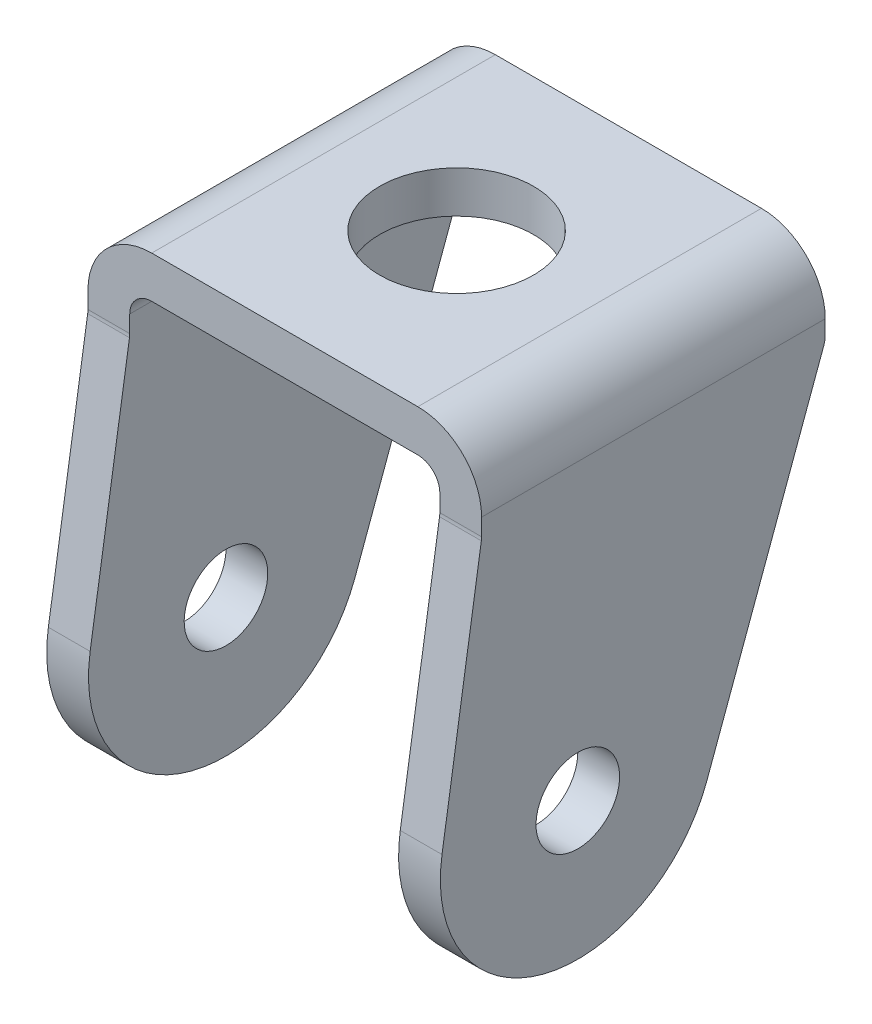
ISO-10303-21;
HEADER;
FILE_DESCRIPTION(('STEP AP214'),'2;1');
FILE_NAME('part.step','',(''),(''),'','','');
FILE_SCHEMA(('AUTOMOTIVE_DESIGN { 1 0 10303 214 1 1 1 1 }'));
ENDSEC;
DATA;
#1=APPLICATION_CONTEXT('core data for automotive mechanical design processes');
#2=APPLICATION_PROTOCOL_DEFINITION('international standard','automotive_design',2000,#1);
#3=PRODUCT_CONTEXT('',#1,'mechanical');
#4=PRODUCT('Part','Part','',(#3));
#5=PRODUCT_RELATED_PRODUCT_CATEGORY('part','',(#4));
#6=PRODUCT_DEFINITION_FORMATION('','',#4);
#7=PRODUCT_DEFINITION_CONTEXT('part definition',#1,'design');
#8=PRODUCT_DEFINITION('design','',#6,#7);
#9=PRODUCT_DEFINITION_SHAPE('','',#8);
#10=(LENGTH_UNIT() NAMED_UNIT(*) SI_UNIT(.MILLI.,.METRE.));
#11=(NAMED_UNIT(*) PLANE_ANGLE_UNIT() SI_UNIT($,.RADIAN.));
#12=(NAMED_UNIT(*) SI_UNIT($,.STERADIAN.) SOLID_ANGLE_UNIT());
#13=UNCERTAINTY_MEASURE_WITH_UNIT(LENGTH_MEASURE(1.E-05),#10,'distance_accuracy_value','');
#14=(GEOMETRIC_REPRESENTATION_CONTEXT(3) GLOBAL_UNCERTAINTY_ASSIGNED_CONTEXT((#13)) GLOBAL_UNIT_ASSIGNED_CONTEXT((#10,
#11,#12)) REPRESENTATION_CONTEXT('',''));
#15=CARTESIAN_POINT('',(0.,0.,0.));
#16=DIRECTION('',(0.,0.,1.));
#17=DIRECTION('',(1.,0.,0.));
#18=AXIS2_PLACEMENT_3D('',#15,#16,#17);
#19=CARTESIAN_POINT('',(40.64,0.,44.45));
#20=DIRECTION('',(1.,0.,0.));
#21=DIRECTION('',(0.,1.,0.));
#22=AXIS2_PLACEMENT_3D('',#19,#20,#21);
#23=PLANE('',#22);
#24=CARTESIAN_POINT('',(40.64,-41.275,28.575));
#25=DIRECTION('',(1.,0.,0.));
#26=DIRECTION('',(0.,1.,0.));
#27=AXIS2_PLACEMENT_3D('',#24,#25,#26);
#28=CIRCLE('',#27,4.826);
#29=CARTESIAN_POINT('',(40.64,-36.449,28.575));
#30=VERTEX_POINT('',#29);
#31=EDGE_CURVE('E382',#30,#30,#28,.T.);
#32=ORIENTED_EDGE('',*,*,#31,.T.);
#33=EDGE_LOOP('',(#32));
#34=FACE_BOUND('',#33,.T.);
#35=DIRECTION('',(0.,-1.,0.));
#36=VECTOR('',#35,1.);
#37=CARTESIAN_POINT('',(40.64,0.,0.));
#38=LINE('',#37,#36);
#39=CARTESIAN_POINT('',(40.64,-7.366,0.));
#40=VERTEX_POINT('',#39);
#41=CARTESIAN_POINT('',(40.64,-9.07324358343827,0.));
#42=VERTEX_POINT('',#41);
#43=EDGE_CURVE('E438',#40,#42,#38,.T.);
#44=ORIENTED_EDGE('',*,*,#43,.T.);
#45=CARTESIAN_POINT('',(40.64,-9.07324358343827,2.54));
#46=DIRECTION('',(1.,0.,0.));
#47=DIRECTION('',(0.,1.,0.));
#48=AXIS2_PLACEMENT_3D('',#45,#46,#47);
#49=CIRCLE('',#48,2.54);
#50=CARTESIAN_POINT('',(40.64,-9.94905191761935,0.155768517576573));
#51=VERTEX_POINT('',#50);
#52=EDGE_CURVE('E482',#42,#51,#49,.F.);
#53=ORIENTED_EDGE('',*,*,#52,.T.);
#54=DIRECTION('',(0.,-0.938673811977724,0.344806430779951));
#55=VECTOR('',#54,1.);
#56=CARTESIAN_POINT('',(40.64,-15.5191623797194,2.20185724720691));
#57=LINE('',#56,#55);
#58=CARTESIAN_POINT('',(40.64,-46.7488020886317,13.6735532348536));
#59=VERTEX_POINT('',#58);
#60=EDGE_CURVE('E407',#51,#59,#57,.T.);
#61=ORIENTED_EDGE('',*,*,#60,.T.);
#62=CARTESIAN_POINT('',(40.64,-41.275,28.575));
#63=DIRECTION('',(1.,0.,0.));
#64=DIRECTION('',(0.,1.,0.));
#65=AXIS2_PLACEMENT_3D('',#62,#63,#64);
#66=CIRCLE('',#65,15.875);
#67=CARTESIAN_POINT('',(40.64,-38.8273080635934,44.2601658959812));
#68=VERTEX_POINT('',#67);
#69=EDGE_CURVE('E426',#68,#59,#66,.T.);
#70=ORIENTED_EDGE('',*,*,#69,.F.);
#71=DIRECTION('',(0.,0.988041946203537,-0.154185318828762));
#72=VECTOR('',#71,1.);
#73=CARTESIAN_POINT('',(40.64,-0.95196558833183,38.3496660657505));
#74=LINE('',#73,#72);
#75=CARTESIAN_POINT('',(40.64,-9.71963752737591,39.717873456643));
#76=VERTEX_POINT('',#75);
#77=EDGE_CURVE('E435',#68,#76,#74,.T.);
#78=ORIENTED_EDGE('',*,*,#77,.T.);
#79=CARTESIAN_POINT('',(40.64,-9.32800681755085,42.2275));
#80=DIRECTION('',(1.,0.,0.));
#81=DIRECTION('',(0.,1.,0.));
#82=AXIS2_PLACEMENT_3D('',#79,#80,#81);
#83=CIRCLE('',#82,2.54);
#84=CARTESIAN_POINT('',(40.64,-9.32800681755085,39.6875));
#85=VERTEX_POINT('',#84);
#86=EDGE_CURVE('E508',#76,#85,#83,.T.);
#87=ORIENTED_EDGE('',*,*,#86,.T.);
#88=DIRECTION('',(0.,1.,0.));
#89=VECTOR('',#88,1.);
#90=CARTESIAN_POINT('',(40.64,0.,39.6875));
#91=LINE('',#90,#89);
#92=CARTESIAN_POINT('',(40.64,-7.366,39.6875));
#93=VERTEX_POINT('',#92);
#94=EDGE_CURVE('E432',#85,#93,#91,.T.);
#95=ORIENTED_EDGE('',*,*,#94,.T.);
#96=DIRECTION('',(0.,0.,-1.));
#97=VECTOR('',#96,1.);
#98=CARTESIAN_POINT('',(40.64,-7.366,0.));
#99=LINE('',#98,#97);
#100=EDGE_CURVE('E479',#93,#40,#99,.T.);
#101=ORIENTED_EDGE('',*,*,#100,.T.);
#102=EDGE_LOOP('',(#44,#53,#61,#70,#78,#87,#95,#101));
#103=FACE_BOUND('',#102,.T.);
#104=ADVANCED_FACE('F229',(#34,#103),#23,.F.);
#105=CARTESIAN_POINT('',(45.466,0.,44.45));
#106=DIRECTION('',(1.,0.,0.));
#107=DIRECTION('',(0.,1.,0.));
#108=AXIS2_PLACEMENT_3D('',#105,#106,#107);
#109=PLANE('',#108);
#110=CARTESIAN_POINT('',(45.466,-41.275,28.575));
#111=DIRECTION('',(-1.,0.,0.));
#112=DIRECTION('',(0.,-1.,0.));
#113=AXIS2_PLACEMENT_3D('',#110,#111,#112);
#114=CIRCLE('',#113,4.826);
#115=CARTESIAN_POINT('',(45.466,-46.101,28.575));
#116=VERTEX_POINT('',#115);
#117=EDGE_CURVE('E464',#116,#116,#114,.T.);
#118=ORIENTED_EDGE('',*,*,#117,.T.);
#119=EDGE_LOOP('',(#118));
#120=FACE_BOUND('',#119,.T.);
#121=DIRECTION('',(0.,-1.,0.));
#122=VECTOR('',#121,1.);
#123=CARTESIAN_POINT('',(45.466,0.,0.));
#124=LINE('',#123,#122);
#125=CARTESIAN_POINT('',(45.466,-7.366,0.));
#126=VERTEX_POINT('',#125);
#127=CARTESIAN_POINT('',(45.466,-9.07324358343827,0.));
#128=VERTEX_POINT('',#127);
#129=EDGE_CURVE('E441',#126,#128,#124,.T.);
#130=ORIENTED_EDGE('',*,*,#129,.F.);
#131=DIRECTION('',(0.,0.,-1.));
#132=VECTOR('',#131,1.);
#133=CARTESIAN_POINT('',(45.466,-7.366,44.45));
#134=LINE('',#133,#132);
#135=CARTESIAN_POINT('',(45.466,-7.366,39.6875));
#136=VERTEX_POINT('',#135);
#137=EDGE_CURVE('E251',#126,#136,#134,.F.);
#138=ORIENTED_EDGE('',*,*,#137,.T.);
#139=DIRECTION('',(0.,1.,0.));
#140=VECTOR('',#139,1.);
#141=CARTESIAN_POINT('',(45.466,-28.575,39.6875));
#142=LINE('',#141,#140);
#143=CARTESIAN_POINT('',(45.466,-9.32800681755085,39.6875));
#144=VERTEX_POINT('',#143);
#145=EDGE_CURVE('E393',#144,#136,#142,.T.);
#146=ORIENTED_EDGE('',*,*,#145,.F.);
#147=CARTESIAN_POINT('',(45.466,-9.32800681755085,42.2275));
#148=DIRECTION('',(1.,0.,0.));
#149=DIRECTION('',(0.,1.,0.));
#150=AXIS2_PLACEMENT_3D('',#147,#148,#149);
#151=CIRCLE('',#150,2.54);
#152=CARTESIAN_POINT('',(45.466,-9.7196375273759,39.717873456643));
#153=VERTEX_POINT('',#152);
#154=EDGE_CURVE('E506',#144,#153,#151,.F.);
#155=ORIENTED_EDGE('',*,*,#154,.T.);
#156=DIRECTION('',(0.,0.988041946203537,-0.154185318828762));
#157=VECTOR('',#156,1.);
#158=CARTESIAN_POINT('',(45.466,-16.8612179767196,40.8323270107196));
#159=LINE('',#158,#157);
#160=CARTESIAN_POINT('',(45.466,-38.8273080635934,44.2601658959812));
#161=VERTEX_POINT('',#160);
#162=EDGE_CURVE('E412',#161,#153,#159,.T.);
#163=ORIENTED_EDGE('',*,*,#162,.F.);
#164=CARTESIAN_POINT('',(45.466,-41.275,28.575));
#165=DIRECTION('',(1.,0.,0.));
#166=DIRECTION('',(0.,1.,0.));
#167=AXIS2_PLACEMENT_3D('',#164,#165,#166);
#168=CIRCLE('',#167,15.875);
#169=CARTESIAN_POINT('',(45.466,-46.7488020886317,13.6735532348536));
#170=VERTEX_POINT('',#169);
#171=EDGE_CURVE('E409',#161,#170,#168,.T.);
#172=ORIENTED_EDGE('',*,*,#171,.T.);
#173=DIRECTION('',(0.,-0.938673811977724,0.344806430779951));
#174=VECTOR('',#173,1.);
#175=CARTESIAN_POINT('',(45.466,-15.2307912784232,2.09592885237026));
#176=LINE('',#175,#174);
#177=CARTESIAN_POINT('',(45.466,-9.94905191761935,0.155768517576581));
#178=VERTEX_POINT('',#177);
#179=EDGE_CURVE('E399',#178,#170,#176,.T.);
#180=ORIENTED_EDGE('',*,*,#179,.F.);
#181=CARTESIAN_POINT('',(45.466,-9.07324358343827,2.54));
#182=DIRECTION('',(1.,0.,0.));
#183=DIRECTION('',(0.,1.,0.));
#184=AXIS2_PLACEMENT_3D('',#181,#182,#183);
#185=CIRCLE('',#184,2.54);
#186=EDGE_CURVE('E472',#178,#128,#185,.T.);
#187=ORIENTED_EDGE('',*,*,#186,.T.);
#188=EDGE_LOOP('',(#130,#138,#146,#155,#163,#172,#180,#187));
#189=FACE_BOUND('',#188,.T.);
#190=ADVANCED_FACE('F543',(#120,#189),#109,.T.);
#191=CARTESIAN_POINT('',(0.,0.,44.45));
#192=DIRECTION('',(-1.,0.,0.));
#193=DIRECTION('',(0.,-1.,0.));
#194=AXIS2_PLACEMENT_3D('',#191,#192,#193);
#195=PLANE('',#194);
#196=CARTESIAN_POINT('',(0.,-41.275,28.575));
#197=DIRECTION('',(-1.,0.,0.));
#198=DIRECTION('',(0.,-1.,0.));
#199=AXIS2_PLACEMENT_3D('',#196,#197,#198);
#200=CIRCLE('',#199,4.826);
#201=CARTESIAN_POINT('',(0.,-46.101,28.575));
#202=VERTEX_POINT('',#201);
#203=EDGE_CURVE('E468',#202,#202,#200,.T.);
#204=ORIENTED_EDGE('',*,*,#203,.F.);
#205=EDGE_LOOP('',(#204));
#206=FACE_BOUND('',#205,.T.);
#207=DIRECTION('',(0.,1.,0.));
#208=VECTOR('',#207,1.);
#209=CARTESIAN_POINT('',(0.,-28.575,39.6875));
#210=LINE('',#209,#208);
#211=CARTESIAN_POINT('',(0.,-9.32800681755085,39.6875));
#212=VERTEX_POINT('',#211);
#213=CARTESIAN_POINT('',(0.,-7.366,39.6875));
#214=VERTEX_POINT('',#213);
#215=EDGE_CURVE('E417',#212,#214,#210,.T.);
#216=ORIENTED_EDGE('',*,*,#215,.T.);
#217=DIRECTION('',(0.,0.,-1.));
#218=VECTOR('',#217,1.);
#219=CARTESIAN_POINT('',(0.,-7.366,44.45));
#220=LINE('',#219,#218);
#221=CARTESIAN_POINT('',(0.,-7.366,0.));
#222=VERTEX_POINT('',#221);
#223=EDGE_CURVE('E12',#214,#222,#220,.T.);
#224=ORIENTED_EDGE('',*,*,#223,.T.);
#225=DIRECTION('',(0.,1.,0.));
#226=VECTOR('',#225,1.);
#227=CARTESIAN_POINT('',(0.,0.,0.));
#228=LINE('',#227,#226);
#229=CARTESIAN_POINT('',(0.,-9.07324358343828,0.));
#230=VERTEX_POINT('',#229);
#231=EDGE_CURVE('E446',#230,#222,#228,.T.);
#232=ORIENTED_EDGE('',*,*,#231,.F.);
#233=CARTESIAN_POINT('',(0.,-9.07324358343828,2.54));
#234=DIRECTION('',(-1.,0.,0.));
#235=DIRECTION('',(0.,-1.,0.));
#236=AXIS2_PLACEMENT_3D('',#233,#234,#235);
#237=CIRCLE('',#236,2.54);
#238=CARTESIAN_POINT('',(0.,-9.94905191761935,0.155768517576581));
#239=VERTEX_POINT('',#238);
#240=EDGE_CURVE('E376',#230,#239,#237,.T.);
#241=ORIENTED_EDGE('',*,*,#240,.T.);
#242=DIRECTION('',(0.,-0.938673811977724,0.344806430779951));
#243=VECTOR('',#242,1.);
#244=CARTESIAN_POINT('',(0.,-15.2307912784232,2.09592885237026));
#245=LINE('',#244,#243);
#246=CARTESIAN_POINT('',(0.,-46.7488020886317,13.6735532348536));
#247=VERTEX_POINT('',#246);
#248=EDGE_CURVE('E369',#239,#247,#245,.T.);
#249=ORIENTED_EDGE('',*,*,#248,.T.);
#250=CARTESIAN_POINT('',(0.,-41.275,28.575));
#251=DIRECTION('',(1.,0.,0.));
#252=DIRECTION('',(0.,1.,0.));
#253=AXIS2_PLACEMENT_3D('',#250,#251,#252);
#254=CIRCLE('',#253,15.875);
#255=CARTESIAN_POINT('',(0.,-38.8273080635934,44.2601658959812));
#256=VERTEX_POINT('',#255);
#257=EDGE_CURVE('E373',#256,#247,#254,.T.);
#258=ORIENTED_EDGE('',*,*,#257,.F.);
#259=DIRECTION('',(0.,0.988041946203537,-0.154185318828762));
#260=VECTOR('',#259,1.);
#261=CARTESIAN_POINT('',(0.,-16.8612179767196,40.8323270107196));
#262=LINE('',#261,#260);
#263=CARTESIAN_POINT('',(0.,-9.71963752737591,39.717873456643));
#264=VERTEX_POINT('',#263);
#265=EDGE_CURVE('E392',#256,#264,#262,.T.);
#266=ORIENTED_EDGE('',*,*,#265,.T.);
#267=CARTESIAN_POINT('',(0.,-9.32800681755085,42.2275));
#268=DIRECTION('',(-1.,0.,0.));
#269=DIRECTION('',(0.,-1.,0.));
#270=AXIS2_PLACEMENT_3D('',#267,#268,#269);
#271=CIRCLE('',#270,2.54);
#272=EDGE_CURVE('E512',#264,#212,#271,.F.);
#273=ORIENTED_EDGE('',*,*,#272,.T.);
#274=EDGE_LOOP('',(#216,#224,#232,#241,#249,#258,#266,#273));
#275=FACE_BOUND('',#274,.T.);
#276=ADVANCED_FACE('F371',(#206,#275),#195,.T.);
#277=CARTESIAN_POINT('',(4.826,0.,44.45));
#278=DIRECTION('',(-1.,0.,0.));
#279=DIRECTION('',(0.,-1.,0.));
#280=AXIS2_PLACEMENT_3D('',#277,#278,#279);
#281=PLANE('',#280);
#282=CARTESIAN_POINT('',(4.826,-41.275,28.575));
#283=DIRECTION('',(-1.,0.,0.));
#284=DIRECTION('',(0.,-1.,0.));
#285=AXIS2_PLACEMENT_3D('',#282,#283,#284);
#286=CIRCLE('',#285,4.826);
#287=CARTESIAN_POINT('',(4.826,-46.101,28.575));
#288=VERTEX_POINT('',#287);
#289=EDGE_CURVE('E461',#288,#288,#286,.T.);
#290=ORIENTED_EDGE('',*,*,#289,.T.);
#291=EDGE_LOOP('',(#290));
#292=FACE_BOUND('',#291,.T.);
#293=DIRECTION('',(0.,0.938673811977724,-0.344806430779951));
#294=VECTOR('',#293,1.);
#295=CARTESIAN_POINT('',(4.826,-15.5191623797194,2.20185724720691));
#296=LINE('',#295,#294);
#297=CARTESIAN_POINT('',(4.826,-46.7488020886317,13.6735532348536));
#298=VERTEX_POINT('',#297);
#299=CARTESIAN_POINT('',(4.826,-9.94905191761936,0.155768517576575));
#300=VERTEX_POINT('',#299);
#301=EDGE_CURVE('E398',#298,#300,#296,.T.);
#302=ORIENTED_EDGE('',*,*,#301,.T.);
#303=CARTESIAN_POINT('',(4.826,-9.07324358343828,2.54));
#304=DIRECTION('',(-1.,0.,0.));
#305=DIRECTION('',(0.,-1.,0.));
#306=AXIS2_PLACEMENT_3D('',#303,#304,#305);
#307=CIRCLE('',#306,2.54);
#308=CARTESIAN_POINT('',(4.826,-9.07324358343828,0.));
#309=VERTEX_POINT('',#308);
#310=EDGE_CURVE('E488',#300,#309,#307,.F.);
#311=ORIENTED_EDGE('',*,*,#310,.T.);
#312=DIRECTION('',(0.,1.,0.));
#313=VECTOR('',#312,1.);
#314=CARTESIAN_POINT('',(4.826,0.,0.));
#315=LINE('',#314,#313);
#316=CARTESIAN_POINT('',(4.826,-7.366,0.));
#317=VERTEX_POINT('',#316);
#318=EDGE_CURVE('E449',#309,#317,#315,.T.);
#319=ORIENTED_EDGE('',*,*,#318,.T.);
#320=DIRECTION('',(0.,0.,-1.));
#321=VECTOR('',#320,1.);
#322=CARTESIAN_POINT('',(4.826,-7.366,39.6875));
#323=LINE('',#322,#321);
#324=CARTESIAN_POINT('',(4.826,-7.366,39.6875));
#325=VERTEX_POINT('',#324);
#326=EDGE_CURVE('E486',#317,#325,#323,.F.);
#327=ORIENTED_EDGE('',*,*,#326,.T.);
#328=DIRECTION('',(0.,-1.,0.));
#329=VECTOR('',#328,1.);
#330=CARTESIAN_POINT('',(4.826,0.,39.6875));
#331=LINE('',#330,#329);
#332=CARTESIAN_POINT('',(4.826,-9.32800681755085,39.6875));
#333=VERTEX_POINT('',#332);
#334=EDGE_CURVE('E429',#325,#333,#331,.T.);
#335=ORIENTED_EDGE('',*,*,#334,.T.);
#336=CARTESIAN_POINT('',(4.826,-9.32800681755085,42.2275));
#337=DIRECTION('',(-1.,0.,0.));
#338=DIRECTION('',(0.,-1.,0.));
#339=AXIS2_PLACEMENT_3D('',#336,#337,#338);
#340=CIRCLE('',#339,2.54);
#341=CARTESIAN_POINT('',(4.826,-9.71963752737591,39.717873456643));
#342=VERTEX_POINT('',#341);
#343=EDGE_CURVE('E510',#333,#342,#340,.T.);
#344=ORIENTED_EDGE('',*,*,#343,.T.);
#345=DIRECTION('',(0.,-0.988041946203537,0.154185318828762));
#346=VECTOR('',#345,1.);
#347=CARTESIAN_POINT('',(4.826,-0.951965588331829,38.3496660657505));
#348=LINE('',#347,#346);
#349=CARTESIAN_POINT('',(4.826,-38.8273080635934,44.2601658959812));
#350=VERTEX_POINT('',#349);
#351=EDGE_CURVE('E458',#342,#350,#348,.T.);
#352=ORIENTED_EDGE('',*,*,#351,.T.);
#353=CARTESIAN_POINT('',(4.826,-41.275,28.575));
#354=DIRECTION('',(-1.,0.,0.));
#355=DIRECTION('',(0.,-1.,0.));
#356=AXIS2_PLACEMENT_3D('',#353,#354,#355);
#357=CIRCLE('',#356,15.875);
#358=EDGE_CURVE('E423',#298,#350,#357,.T.);
#359=ORIENTED_EDGE('',*,*,#358,.F.);
#360=EDGE_LOOP('',(#302,#311,#319,#327,#335,#344,#352,#359));
#361=FACE_BOUND('',#360,.T.);
#362=ADVANCED_FACE('F571',(#292,#361),#281,.F.);
#363=CARTESIAN_POINT('',(0.,0.,44.45));
#364=DIRECTION('',(0.,1.,0.));
#365=DIRECTION('',(0.,0.,1.));
#366=AXIS2_PLACEMENT_3D('',#363,#364,#365);
#367=PLANE('',#366);
#368=CARTESIAN_POINT('',(22.733,0.,19.84375));
#369=DIRECTION('',(0.,1.,0.));
#370=DIRECTION('',(0.,0.,1.));
#371=AXIS2_PLACEMENT_3D('',#368,#369,#370);
#372=CIRCLE('',#371,8.89);
#373=CARTESIAN_POINT('',(22.733,0.,28.73375));
#374=VERTEX_POINT('',#373);
#375=EDGE_CURVE('E469',#374,#374,#372,.T.);
#376=ORIENTED_EDGE('',*,*,#375,.F.);
#377=EDGE_LOOP('',(#376));
#378=FACE_BOUND('',#377,.T.);
#379=DIRECTION('',(1.,0.,0.));
#380=VECTOR('',#379,1.);
#381=CARTESIAN_POINT('',(0.,0.,39.6875));
#382=LINE('',#381,#380);
#383=CARTESIAN_POINT('',(7.366,0.,39.6875));
#384=VERTEX_POINT('',#383);
#385=CARTESIAN_POINT('',(38.1,0.,39.6875));
#386=VERTEX_POINT('',#385);
#387=EDGE_CURVE('E420',#384,#386,#382,.T.);
#388=ORIENTED_EDGE('',*,*,#387,.T.);
#389=DIRECTION('',(0.,0.,-1.));
#390=VECTOR('',#389,1.);
#391=CARTESIAN_POINT('',(38.1,0.,44.45));
#392=LINE('',#391,#390);
#393=CARTESIAN_POINT('',(38.1,0.,0.));
#394=VERTEX_POINT('',#393);
#395=EDGE_CURVE('E524',#386,#394,#392,.T.);
#396=ORIENTED_EDGE('',*,*,#395,.T.);
#397=DIRECTION('',(1.,0.,0.));
#398=VECTOR('',#397,1.);
#399=CARTESIAN_POINT('',(0.,0.,0.));
#400=LINE('',#399,#398);
#401=CARTESIAN_POINT('',(7.366,0.,0.));
#402=VERTEX_POINT('',#401);
#403=EDGE_CURVE('E443',#402,#394,#400,.T.);
#404=ORIENTED_EDGE('',*,*,#403,.F.);
#405=DIRECTION('',(0.,0.,-1.));
#406=VECTOR('',#405,1.);
#407=CARTESIAN_POINT('',(7.366,0.,44.45));
#408=LINE('',#407,#406);
#409=EDGE_CURVE('E522',#402,#384,#408,.F.);
#410=ORIENTED_EDGE('',*,*,#409,.T.);
#411=EDGE_LOOP('',(#388,#396,#404,#410));
#412=FACE_BOUND('',#411,.T.);
#413=ADVANCED_FACE('F537',(#378,#412),#367,.T.);
#414=CARTESIAN_POINT('',(0.,-4.826,44.45));
#415=DIRECTION('',(0.,1.,0.));
#416=DIRECTION('',(0.,0.,1.));
#417=AXIS2_PLACEMENT_3D('',#414,#415,#416);
#418=PLANE('',#417);
#419=CARTESIAN_POINT('',(22.733,-4.826,19.84375));
#420=DIRECTION('',(0.,1.,0.));
#421=DIRECTION('',(0.,0.,1.));
#422=AXIS2_PLACEMENT_3D('',#419,#420,#421);
#423=CIRCLE('',#422,8.89);
#424=CARTESIAN_POINT('',(22.733,-4.826,28.73375));
#425=VERTEX_POINT('',#424);
#426=EDGE_CURVE('E465',#425,#425,#423,.T.);
#427=ORIENTED_EDGE('',*,*,#426,.T.);
#428=EDGE_LOOP('',(#427));
#429=FACE_BOUND('',#428,.T.);
#430=DIRECTION('',(-1.,0.,0.));
#431=VECTOR('',#430,1.);
#432=CARTESIAN_POINT('',(0.,-4.826,39.6875));
#433=LINE('',#432,#431);
#434=CARTESIAN_POINT('',(38.1,-4.826,39.6875));
#435=VERTEX_POINT('',#434);
#436=CARTESIAN_POINT('',(7.366,-4.826,39.6875));
#437=VERTEX_POINT('',#436);
#438=EDGE_CURVE('E455',#435,#437,#433,.T.);
#439=ORIENTED_EDGE('',*,*,#438,.T.);
#440=DIRECTION('',(0.,0.,-1.));
#441=VECTOR('',#440,1.);
#442=CARTESIAN_POINT('',(7.366,-4.826,0.));
#443=LINE('',#442,#441);
#444=CARTESIAN_POINT('',(7.366,-4.826,0.));
#445=VERTEX_POINT('',#444);
#446=EDGE_CURVE('E503',#437,#445,#443,.T.);
#447=ORIENTED_EDGE('',*,*,#446,.T.);
#448=DIRECTION('',(1.,0.,0.));
#449=VECTOR('',#448,1.);
#450=CARTESIAN_POINT('',(0.,-4.826,0.));
#451=LINE('',#450,#449);
#452=CARTESIAN_POINT('',(38.1,-4.826,0.));
#453=VERTEX_POINT('',#452);
#454=EDGE_CURVE('E452',#445,#453,#451,.T.);
#455=ORIENTED_EDGE('',*,*,#454,.T.);
#456=DIRECTION('',(0.,0.,-1.));
#457=VECTOR('',#456,1.);
#458=CARTESIAN_POINT('',(38.1,-4.826,39.6875));
#459=LINE('',#458,#457);
#460=EDGE_CURVE('E501',#453,#435,#459,.F.);
#461=ORIENTED_EDGE('',*,*,#460,.T.);
#462=EDGE_LOOP('',(#439,#447,#455,#461));
#463=FACE_BOUND('',#462,.T.);
#464=ADVANCED_FACE('F561',(#429,#463),#418,.F.);
#465=CARTESIAN_POINT('',(40.64,-57.15,0.));
#466=DIRECTION('',(0.,0.,-1.));
#467=DIRECTION('',(-1.,0.,0.));
#468=AXIS2_PLACEMENT_3D('',#465,#466,#467);
#469=PLANE('',#468);
#470=ORIENTED_EDGE('',*,*,#403,.T.);
#471=CARTESIAN_POINT('',(38.1,-7.366,0.));
#472=DIRECTION('',(0.,0.,-1.));
#473=DIRECTION('',(-1.,0.,0.));
#474=AXIS2_PLACEMENT_3D('',#471,#472,#473);
#475=CIRCLE('',#474,7.366);
#476=EDGE_CURVE('E529',#394,#126,#475,.T.);
#477=ORIENTED_EDGE('',*,*,#476,.T.);
#478=ORIENTED_EDGE('',*,*,#129,.T.);
#479=DIRECTION('',(1.,0.,0.));
#480=VECTOR('',#479,1.);
#481=CARTESIAN_POINT('',(40.64,-9.07324358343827,0.));
#482=LINE('',#481,#480);
#483=EDGE_CURVE('E477',#128,#42,#482,.F.);
#484=ORIENTED_EDGE('',*,*,#483,.T.);
#485=ORIENTED_EDGE('',*,*,#43,.F.);
#486=CARTESIAN_POINT('',(38.1,-7.366,0.));
#487=DIRECTION('',(0.,0.,-1.));
#488=DIRECTION('',(-1.,0.,0.));
#489=AXIS2_PLACEMENT_3D('',#486,#487,#488);
#490=CIRCLE('',#489,2.54);
#491=EDGE_CURVE('E518',#40,#453,#490,.F.);
#492=ORIENTED_EDGE('',*,*,#491,.T.);
#493=ORIENTED_EDGE('',*,*,#454,.F.);
#494=CARTESIAN_POINT('',(7.366,-7.366,0.));
#495=DIRECTION('',(0.,0.,-1.));
#496=DIRECTION('',(-1.,0.,0.));
#497=AXIS2_PLACEMENT_3D('',#494,#495,#496);
#498=CIRCLE('',#497,2.54);
#499=EDGE_CURVE('E514',#445,#317,#498,.F.);
#500=ORIENTED_EDGE('',*,*,#499,.T.);
#501=ORIENTED_EDGE('',*,*,#318,.F.);
#502=DIRECTION('',(1.,0.,0.));
#503=VECTOR('',#502,1.);
#504=CARTESIAN_POINT('',(0.,-9.07324358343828,0.));
#505=LINE('',#504,#503);
#506=EDGE_CURVE('E475',#309,#230,#505,.F.);
#507=ORIENTED_EDGE('',*,*,#506,.T.);
#508=ORIENTED_EDGE('',*,*,#231,.T.);
#509=CARTESIAN_POINT('',(7.366,-7.366,0.));
#510=DIRECTION('',(0.,0.,-1.));
#511=DIRECTION('',(-1.,0.,0.));
#512=AXIS2_PLACEMENT_3D('',#509,#510,#511);
#513=CIRCLE('',#512,7.366);
#514=EDGE_CURVE('E527',#222,#402,#513,.T.);
#515=ORIENTED_EDGE('',*,*,#514,.T.);
#516=EDGE_LOOP('',(#470,#477,#478,#484,#485,#492,#493,#500,#501,#507,#508,#515));
#517=FACE_BOUND('',#516,.T.);
#518=ADVANCED_FACE('F542',(#517),#469,.T.);
#519=CARTESIAN_POINT('',(0.,-16.8612179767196,40.8323270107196));
#520=DIRECTION('',(0.,-0.154185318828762,-0.988041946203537));
#521=DIRECTION('',(0.,0.988041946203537,-0.154185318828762));
#522=AXIS2_PLACEMENT_3D('',#519,#520,#521);
#523=PLANE('',#522);
#524=ORIENTED_EDGE('',*,*,#162,.T.);
#525=DIRECTION('',(1.,0.,0.));
#526=VECTOR('',#525,1.);
#527=CARTESIAN_POINT('',(40.64,-9.71963752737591,39.717873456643));
#528=LINE('',#527,#526);
#529=EDGE_CURVE('E497',#153,#76,#528,.F.);
#530=ORIENTED_EDGE('',*,*,#529,.T.);
#531=ORIENTED_EDGE('',*,*,#77,.F.);
#532=DIRECTION('',(1.,0.,0.));
#533=VECTOR('',#532,1.);
#534=CARTESIAN_POINT('',(0.,-38.8273080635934,44.2601658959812));
#535=LINE('',#534,#533);
#536=EDGE_CURVE('E419',#68,#161,#535,.T.);
#537=ORIENTED_EDGE('',*,*,#536,.T.);
#538=EDGE_LOOP('',(#524,#530,#531,#537));
#539=FACE_BOUND('',#538,.T.);
#540=ADVANCED_FACE('F617',(#539),#523,.F.);
#541=ORIENTED_EDGE('',*,*,#351,.F.);
#542=DIRECTION('',(1.,0.,0.));
#543=VECTOR('',#542,1.);
#544=CARTESIAN_POINT('',(0.,-9.71963752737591,39.717873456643));
#545=LINE('',#544,#543);
#546=EDGE_CURVE('E499',#342,#264,#545,.F.);
#547=ORIENTED_EDGE('',*,*,#546,.T.);
#548=ORIENTED_EDGE('',*,*,#265,.F.);
#549=EDGE_CURVE('E390',#256,#350,#535,.T.);
#550=ORIENTED_EDGE('',*,*,#549,.T.);
#551=EDGE_LOOP('',(#541,#547,#548,#550));
#552=FACE_BOUND('',#551,.T.);
#553=ADVANCED_FACE('F616',(#552),#523,.F.);
#554=CARTESIAN_POINT('',(0.,-28.575,39.6875));
#555=DIRECTION('',(0.,0.,-1.));
#556=DIRECTION('',(-1.,0.,0.));
#557=AXIS2_PLACEMENT_3D('',#554,#555,#556);
#558=PLANE('',#557);
#559=ORIENTED_EDGE('',*,*,#145,.T.);
#560=CARTESIAN_POINT('',(38.1,-7.366,39.6875));
#561=DIRECTION('',(0.,0.,-1.));
#562=DIRECTION('',(-1.,0.,0.));
#563=AXIS2_PLACEMENT_3D('',#560,#561,#562);
#564=CIRCLE('',#563,7.366);
#565=EDGE_CURVE('E236',#136,#386,#564,.F.);
#566=ORIENTED_EDGE('',*,*,#565,.T.);
#567=ORIENTED_EDGE('',*,*,#387,.F.);
#568=CARTESIAN_POINT('',(7.366,-7.366,39.6875));
#569=DIRECTION('',(0.,0.,-1.));
#570=DIRECTION('',(-1.,0.,0.));
#571=AXIS2_PLACEMENT_3D('',#568,#569,#570);
#572=CIRCLE('',#571,7.366);
#573=EDGE_CURVE('E243',#384,#214,#572,.F.);
#574=ORIENTED_EDGE('',*,*,#573,.T.);
#575=ORIENTED_EDGE('',*,*,#215,.F.);
#576=DIRECTION('',(1.,0.,0.));
#577=VECTOR('',#576,1.);
#578=CARTESIAN_POINT('',(4.826,-9.32800681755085,39.6875));
#579=LINE('',#578,#577);
#580=EDGE_CURVE('E491',#212,#333,#579,.T.);
#581=ORIENTED_EDGE('',*,*,#580,.T.);
#582=ORIENTED_EDGE('',*,*,#334,.F.);
#583=CARTESIAN_POINT('',(7.366,-7.366,39.6875));
#584=DIRECTION('',(0.,0.,-1.));
#585=DIRECTION('',(-1.,0.,0.));
#586=AXIS2_PLACEMENT_3D('',#583,#584,#585);
#587=CIRCLE('',#586,2.54);
#588=EDGE_CURVE('E516',#325,#437,#587,.T.);
#589=ORIENTED_EDGE('',*,*,#588,.T.);
#590=ORIENTED_EDGE('',*,*,#438,.F.);
#591=CARTESIAN_POINT('',(38.1,-7.366,39.6875));
#592=DIRECTION('',(0.,0.,-1.));
#593=DIRECTION('',(-1.,0.,0.));
#594=AXIS2_PLACEMENT_3D('',#591,#592,#593);
#595=CIRCLE('',#594,2.54);
#596=EDGE_CURVE('E520',#435,#93,#595,.T.);
#597=ORIENTED_EDGE('',*,*,#596,.T.);
#598=ORIENTED_EDGE('',*,*,#94,.F.);
#599=DIRECTION('',(1.,0.,0.));
#600=VECTOR('',#599,1.);
#601=CARTESIAN_POINT('',(45.466,-9.32800681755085,39.6875));
#602=LINE('',#601,#600);
#603=EDGE_CURVE('E494',#85,#144,#602,.T.);
#604=ORIENTED_EDGE('',*,*,#603,.T.);
#605=EDGE_LOOP('',(#559,#566,#567,#574,#575,#581,#582,#589,#590,#597,#598,#604));
#606=FACE_BOUND('',#605,.T.);
#607=ADVANCED_FACE('F533',(#606),#558,.F.);
#608=CARTESIAN_POINT('',(0.,-41.275,28.575));
#609=DIRECTION('',(1.,0.,0.));
#610=DIRECTION('',(0.,1.,0.));
#611=AXIS2_PLACEMENT_3D('',#608,#609,#610);
#612=CYLINDRICAL_SURFACE('',#611,15.875);
#613=ORIENTED_EDGE('',*,*,#69,.T.);
#614=DIRECTION('',(1.,0.,0.));
#615=VECTOR('',#614,1.);
#616=CARTESIAN_POINT('',(0.,-46.7488020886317,13.6735532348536));
#617=LINE('',#616,#615);
#618=EDGE_CURVE('E381',#59,#170,#617,.T.);
#619=ORIENTED_EDGE('',*,*,#618,.T.);
#620=ORIENTED_EDGE('',*,*,#171,.F.);
#621=ORIENTED_EDGE('',*,*,#536,.F.);
#622=EDGE_LOOP('',(#613,#619,#620,#621));
#623=FACE_BOUND('',#622,.T.);
#624=ADVANCED_FACE('F615',(#623),#612,.T.);
#625=ORIENTED_EDGE('',*,*,#358,.T.);
#626=ORIENTED_EDGE('',*,*,#549,.F.);
#627=ORIENTED_EDGE('',*,*,#257,.T.);
#628=EDGE_CURVE('E388',#247,#298,#617,.T.);
#629=ORIENTED_EDGE('',*,*,#628,.T.);
#630=EDGE_LOOP('',(#625,#626,#627,#629));
#631=FACE_BOUND('',#630,.T.);
#632=ADVANCED_FACE('F387',(#631),#612,.T.);
#633=CARTESIAN_POINT('',(0.,-15.2307912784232,2.09592885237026));
#634=DIRECTION('',(0.,0.344806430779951,0.938673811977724));
#635=DIRECTION('',(0.,-0.938673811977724,0.344806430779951));
#636=AXIS2_PLACEMENT_3D('',#633,#634,#635);
#637=PLANE('',#636);
#638=ORIENTED_EDGE('',*,*,#248,.F.);
#639=DIRECTION('',(1.,0.,0.));
#640=VECTOR('',#639,1.);
#641=CARTESIAN_POINT('',(4.82600000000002,-9.94905191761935,0.155768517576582));
#642=LINE('',#641,#640);
#643=EDGE_CURVE('E484',#239,#300,#642,.T.);
#644=ORIENTED_EDGE('',*,*,#643,.T.);
#645=ORIENTED_EDGE('',*,*,#301,.F.);
#646=ORIENTED_EDGE('',*,*,#628,.F.);
#647=EDGE_LOOP('',(#638,#644,#645,#646));
#648=FACE_BOUND('',#647,.T.);
#649=ADVANCED_FACE('F396',(#648),#637,.F.);
#650=ORIENTED_EDGE('',*,*,#60,.F.);
#651=DIRECTION('',(1.,0.,0.));
#652=VECTOR('',#651,1.);
#653=CARTESIAN_POINT('',(45.466,-9.94905191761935,0.155768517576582));
#654=LINE('',#653,#652);
#655=EDGE_CURVE('E460',#51,#178,#654,.T.);
#656=ORIENTED_EDGE('',*,*,#655,.T.);
#657=ORIENTED_EDGE('',*,*,#179,.T.);
#658=ORIENTED_EDGE('',*,*,#618,.F.);
#659=EDGE_LOOP('',(#650,#656,#657,#658));
#660=FACE_BOUND('',#659,.T.);
#661=ADVANCED_FACE('F605',(#660),#637,.F.);
#662=CARTESIAN_POINT('',(45.466,-41.275,28.575));
#663=DIRECTION('',(-1.,0.,0.));
#664=DIRECTION('',(0.,-1.,0.));
#665=AXIS2_PLACEMENT_3D('',#662,#663,#664);
#666=CYLINDRICAL_SURFACE('',#665,4.826);
#667=ORIENTED_EDGE('',*,*,#203,.T.);
#668=EDGE_LOOP('',(#667));
#669=FACE_BOUND('',#668,.T.);
#670=ORIENTED_EDGE('',*,*,#289,.F.);
#671=EDGE_LOOP('',(#670));
#672=FACE_BOUND('',#671,.T.);
#673=ADVANCED_FACE('F596',(#669,#672),#666,.F.);
#674=ORIENTED_EDGE('',*,*,#117,.F.);
#675=EDGE_LOOP('',(#674));
#676=FACE_BOUND('',#675,.T.);
#677=ORIENTED_EDGE('',*,*,#31,.F.);
#678=EDGE_LOOP('',(#677));
#679=FACE_BOUND('',#678,.T.);
#680=ADVANCED_FACE('F593',(#676,#679),#666,.F.);
#681=CARTESIAN_POINT('',(22.733,-57.15,19.84375));
#682=DIRECTION('',(0.,1.,0.));
#683=DIRECTION('',(0.,0.,1.));
#684=AXIS2_PLACEMENT_3D('',#681,#682,#683);
#685=CYLINDRICAL_SURFACE('',#684,8.89);
#686=CARTESIAN_POINT('',(22.733,0.,28.73375));
#687=CARTESIAN_POINT('',(22.733,-0.0502708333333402,28.73375));
#688=CARTESIAN_POINT('',(22.733,-0.100541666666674,28.73375));
#689=CARTESIAN_POINT('',(22.733,-0.20108333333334,28.73375));
#690=CARTESIAN_POINT('',(22.733,-0.251354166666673,28.73375));
#691=CARTESIAN_POINT('',(22.733,-0.35189583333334,28.73375));
#692=CARTESIAN_POINT('',(22.733,-0.402166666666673,28.73375));
#693=CARTESIAN_POINT('',(22.733,-0.50270833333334,28.73375));
#694=CARTESIAN_POINT('',(22.733,-0.552979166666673,28.73375));
#695=CARTESIAN_POINT('',(22.733,-0.65352083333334,28.73375));
#696=CARTESIAN_POINT('',(22.733,-0.703791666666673,28.73375));
#697=CARTESIAN_POINT('',(22.733,-0.80433333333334,28.73375));
#698=CARTESIAN_POINT('',(22.733,-0.854604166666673,28.73375));
#699=CARTESIAN_POINT('',(22.733,-0.95514583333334,28.73375));
#700=CARTESIAN_POINT('',(22.733,-1.00541666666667,28.73375));
#701=CARTESIAN_POINT('',(22.733,-1.10595833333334,28.73375));
#702=CARTESIAN_POINT('',(22.733,-1.15622916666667,28.73375));
#703=CARTESIAN_POINT('',(22.733,-1.25677083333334,28.73375));
#704=CARTESIAN_POINT('',(22.733,-1.30704166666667,28.73375));
#705=CARTESIAN_POINT('',(22.733,-1.40758333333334,28.73375));
#706=CARTESIAN_POINT('',(22.733,-1.45785416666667,28.73375));
#707=CARTESIAN_POINT('',(22.733,-1.55839583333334,28.73375));
#708=CARTESIAN_POINT('',(22.733,-1.60866666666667,28.73375));
#709=CARTESIAN_POINT('',(22.733,-1.70920833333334,28.73375));
#710=CARTESIAN_POINT('',(22.733,-1.75947916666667,28.73375));
#711=CARTESIAN_POINT('',(22.733,-1.86002083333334,28.73375));
#712=CARTESIAN_POINT('',(22.733,-1.91029166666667,28.73375));
#713=CARTESIAN_POINT('',(22.733,-2.01083333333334,28.73375));
#714=CARTESIAN_POINT('',(22.733,-2.06110416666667,28.73375));
#715=CARTESIAN_POINT('',(22.733,-2.16164583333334,28.73375));
#716=CARTESIAN_POINT('',(22.733,-2.21191666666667,28.73375));
#717=CARTESIAN_POINT('',(22.733,-2.31245833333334,28.73375));
#718=CARTESIAN_POINT('',(22.733,-2.36272916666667,28.73375));
#719=CARTESIAN_POINT('',(22.733,-2.46327083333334,28.73375));
#720=CARTESIAN_POINT('',(22.733,-2.51354166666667,28.73375));
#721=CARTESIAN_POINT('',(22.733,-2.61408333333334,28.73375));
#722=CARTESIAN_POINT('',(22.733,-2.66435416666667,28.73375));
#723=CARTESIAN_POINT('',(22.733,-2.76489583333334,28.73375));
#724=CARTESIAN_POINT('',(22.733,-2.81516666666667,28.73375));
#725=CARTESIAN_POINT('',(22.733,-2.91570833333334,28.73375));
#726=CARTESIAN_POINT('',(22.733,-2.96597916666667,28.73375));
#727=CARTESIAN_POINT('',(22.733,-3.06652083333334,28.73375));
#728=CARTESIAN_POINT('',(22.733,-3.11679166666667,28.73375));
#729=CARTESIAN_POINT('',(22.733,-3.21733333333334,28.73375));
#730=CARTESIAN_POINT('',(22.733,-3.26760416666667,28.73375));
#731=CARTESIAN_POINT('',(22.733,-3.36814583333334,28.73375));
#732=CARTESIAN_POINT('',(22.733,-3.41841666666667,28.73375));
#733=CARTESIAN_POINT('',(22.733,-3.51895833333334,28.73375));
#734=CARTESIAN_POINT('',(22.733,-3.56922916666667,28.73375));
#735=CARTESIAN_POINT('',(22.733,-3.66977083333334,28.73375));
#736=CARTESIAN_POINT('',(22.733,-3.72004166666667,28.73375));
#737=CARTESIAN_POINT('',(22.733,-3.82058333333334,28.73375));
#738=CARTESIAN_POINT('',(22.733,-3.87085416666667,28.73375));
#739=CARTESIAN_POINT('',(22.733,-3.97139583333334,28.73375));
#740=CARTESIAN_POINT('',(22.733,-4.02166666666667,28.73375));
#741=CARTESIAN_POINT('',(22.733,-4.12220833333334,28.73375));
#742=CARTESIAN_POINT('',(22.733,-4.17247916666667,28.73375));
#743=CARTESIAN_POINT('',(22.733,-4.27302083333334,28.73375));
#744=CARTESIAN_POINT('',(22.733,-4.32329166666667,28.73375));
#745=CARTESIAN_POINT('',(22.733,-4.42383333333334,28.73375));
#746=CARTESIAN_POINT('',(22.733,-4.47410416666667,28.73375));
#747=CARTESIAN_POINT('',(22.733,-4.57464583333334,28.73375));
#748=CARTESIAN_POINT('',(22.733,-4.62491666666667,28.73375));
#749=CARTESIAN_POINT('',(22.733,-4.72545833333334,28.73375));
#750=CARTESIAN_POINT('',(22.733,-4.77572916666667,28.73375));
#751=CARTESIAN_POINT('',(22.733,-4.826,28.73375));
#752=B_SPLINE_CURVE_WITH_KNOTS('',3,(#686,#687,#688,#689,#690,#691,#692,#693,#694,#695,#696,
#697,#698,#699,#700,#701,#702,#703,#704,#705,#706,#707,#708,#709,#710,#711,#712,#713,#714,#715,
#716,#717,#718,#719,#720,#721,#722,#723,#724,#725,#726,#727,#728,#729,#730,#731,#732,#733,#734,
#735,#736,#737,#738,#739,#740,#741,#742,#743,#744,#745,#746,#747,#748,#749,#750,#751),
.UNSPECIFIED.,.F.,.F.,(4,2,2,2,2,2,2,2,2,2,2,2,2,2,2,2,2,2,2,2,2,2,2,2,2,2,2,2,2,2,2,2,4),(0.,
0.1508125,0.301625,0.4524375,0.60325,0.7540625,0.904874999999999,1.0556875,1.2065,1.3573125,
1.508125,1.6589375,1.80975,1.9605625,2.111375,2.2621875,2.413,2.5638125,2.714625,2.8654375,
3.01625,3.1670625,3.317875,3.4686875,3.6195,3.7703125,3.921125,4.0719375,4.22275,4.3735625,
4.524375,4.6751875,4.826),.UNSPECIFIED.);
#753=EDGE_CURVE('BSEAM595',#374,#425,#752,.T.);
#754=ORIENTED_EDGE('',*,*,#375,.T.);
#755=ORIENTED_EDGE('',*,*,#426,.F.);
#756=ORIENTED_EDGE('',*,*,#753,.T.);
#757=ORIENTED_EDGE('',*,*,#753,.F.);
#758=EDGE_LOOP('',(#754,#756,#755,#757));
#759=FACE_BOUND('',#758,.T.);
#760=ADVANCED_FACE('F595',(#759),#685,.F.);
#761=CARTESIAN_POINT('',(0.,-9.07324358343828,2.54));
#762=DIRECTION('',(-1.,0.,0.));
#763=DIRECTION('',(0.,-1.,0.));
#764=AXIS2_PLACEMENT_3D('',#761,#762,#763);
#765=CYLINDRICAL_SURFACE('',#764,2.54);
#766=ORIENTED_EDGE('',*,*,#52,.F.);
#767=ORIENTED_EDGE('',*,*,#483,.F.);
#768=ORIENTED_EDGE('',*,*,#186,.F.);
#769=ORIENTED_EDGE('',*,*,#655,.F.);
#770=EDGE_LOOP('',(#766,#767,#768,#769));
#771=FACE_BOUND('',#770,.T.);
#772=ADVANCED_FACE('F549',(#771),#765,.T.);
#773=CARTESIAN_POINT('',(0.,-9.07324358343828,2.54));
#774=DIRECTION('',(-1.,0.,0.));
#775=DIRECTION('',(0.,-1.,0.));
#776=AXIS2_PLACEMENT_3D('',#773,#774,#775);
#777=CYLINDRICAL_SURFACE('',#776,2.54);
#778=ORIENTED_EDGE('',*,*,#240,.F.);
#779=ORIENTED_EDGE('',*,*,#506,.F.);
#780=ORIENTED_EDGE('',*,*,#310,.F.);
#781=ORIENTED_EDGE('',*,*,#643,.F.);
#782=EDGE_LOOP('',(#778,#779,#780,#781));
#783=FACE_BOUND('',#782,.T.);
#784=ADVANCED_FACE('F574',(#783),#777,.T.);
#785=CARTESIAN_POINT('',(0.,-9.32800681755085,42.2275));
#786=DIRECTION('',(-1.,0.,0.));
#787=DIRECTION('',(0.,-1.,0.));
#788=AXIS2_PLACEMENT_3D('',#785,#786,#787);
#789=CYLINDRICAL_SURFACE('',#788,2.54);
#790=ORIENTED_EDGE('',*,*,#86,.F.);
#791=ORIENTED_EDGE('',*,*,#529,.F.);
#792=ORIENTED_EDGE('',*,*,#154,.F.);
#793=ORIENTED_EDGE('',*,*,#603,.F.);
#794=EDGE_LOOP('',(#790,#791,#792,#793));
#795=FACE_BOUND('',#794,.T.);
#796=ADVANCED_FACE('F758',(#795),#789,.F.);
#797=CARTESIAN_POINT('',(0.,-9.32800681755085,42.2275));
#798=DIRECTION('',(-1.,0.,0.));
#799=DIRECTION('',(0.,-1.,0.));
#800=AXIS2_PLACEMENT_3D('',#797,#798,#799);
#801=CYLINDRICAL_SURFACE('',#800,2.54);
#802=ORIENTED_EDGE('',*,*,#272,.F.);
#803=ORIENTED_EDGE('',*,*,#546,.F.);
#804=ORIENTED_EDGE('',*,*,#343,.F.);
#805=ORIENTED_EDGE('',*,*,#580,.F.);
#806=EDGE_LOOP('',(#802,#803,#804,#805));
#807=FACE_BOUND('',#806,.T.);
#808=ADVANCED_FACE('F749',(#807),#801,.F.);
#809=CARTESIAN_POINT('',(7.366,-7.366,44.45));
#810=DIRECTION('',(0.,0.,1.));
#811=DIRECTION('',(1.,0.,0.));
#812=AXIS2_PLACEMENT_3D('',#809,#810,#811);
#813=CYLINDRICAL_SURFACE('',#812,2.54);
#814=ORIENTED_EDGE('',*,*,#588,.F.);
#815=ORIENTED_EDGE('',*,*,#326,.F.);
#816=ORIENTED_EDGE('',*,*,#499,.F.);
#817=ORIENTED_EDGE('',*,*,#446,.F.);
#818=EDGE_LOOP('',(#814,#815,#816,#817));
#819=FACE_BOUND('',#818,.T.);
#820=ADVANCED_FACE('F566',(#819),#813,.F.);
#821=CARTESIAN_POINT('',(38.1,-7.366,44.45));
#822=DIRECTION('',(0.,0.,1.));
#823=DIRECTION('',(1.,0.,0.));
#824=AXIS2_PLACEMENT_3D('',#821,#822,#823);
#825=CYLINDRICAL_SURFACE('',#824,2.54);
#826=ORIENTED_EDGE('',*,*,#596,.F.);
#827=ORIENTED_EDGE('',*,*,#460,.F.);
#828=ORIENTED_EDGE('',*,*,#491,.F.);
#829=ORIENTED_EDGE('',*,*,#100,.F.);
#830=EDGE_LOOP('',(#826,#827,#828,#829));
#831=FACE_BOUND('',#830,.T.);
#832=ADVANCED_FACE('F557',(#831),#825,.F.);
#833=CARTESIAN_POINT('',(38.1,-7.366,44.45));
#834=DIRECTION('',(0.,0.,-1.));
#835=DIRECTION('',(-1.,0.,0.));
#836=AXIS2_PLACEMENT_3D('',#833,#834,#835);
#837=CYLINDRICAL_SURFACE('',#836,7.366);
#838=ORIENTED_EDGE('',*,*,#565,.F.);
#839=ORIENTED_EDGE('',*,*,#137,.F.);
#840=ORIENTED_EDGE('',*,*,#476,.F.);
#841=ORIENTED_EDGE('',*,*,#395,.F.);
#842=EDGE_LOOP('',(#838,#839,#840,#841));
#843=FACE_BOUND('',#842,.T.);
#844=ADVANCED_FACE('F540',(#843),#837,.T.);
#845=CARTESIAN_POINT('',(7.366,-7.366,44.45));
#846=DIRECTION('',(0.,0.,-1.));
#847=DIRECTION('',(-1.,0.,0.));
#848=AXIS2_PLACEMENT_3D('',#845,#846,#847);
#849=CYLINDRICAL_SURFACE('',#848,7.366);
#850=ORIENTED_EDGE('',*,*,#573,.F.);
#851=ORIENTED_EDGE('',*,*,#409,.F.);
#852=ORIENTED_EDGE('',*,*,#514,.F.);
#853=ORIENTED_EDGE('',*,*,#223,.F.);
#854=EDGE_LOOP('',(#850,#851,#852,#853));
#855=FACE_BOUND('',#854,.T.);
#856=ADVANCED_FACE('F577',(#855),#849,.T.);
#857=CLOSED_SHELL('',(#104,#190,#276,#362,#413,#464,#518,#540,#553,#607,#624,#632,#649,#661,
#673,#680,#760,#772,#784,#796,#808,#820,#832,#844,#856));
#858=MANIFOLD_SOLID_BREP('B2',#857);
#859=ADVANCED_BREP_SHAPE_REPRESENTATION('',(#18,#858),#14);
#860=SHAPE_DEFINITION_REPRESENTATION(#9,#859);
ENDSEC;
END-ISO-10303-21;
